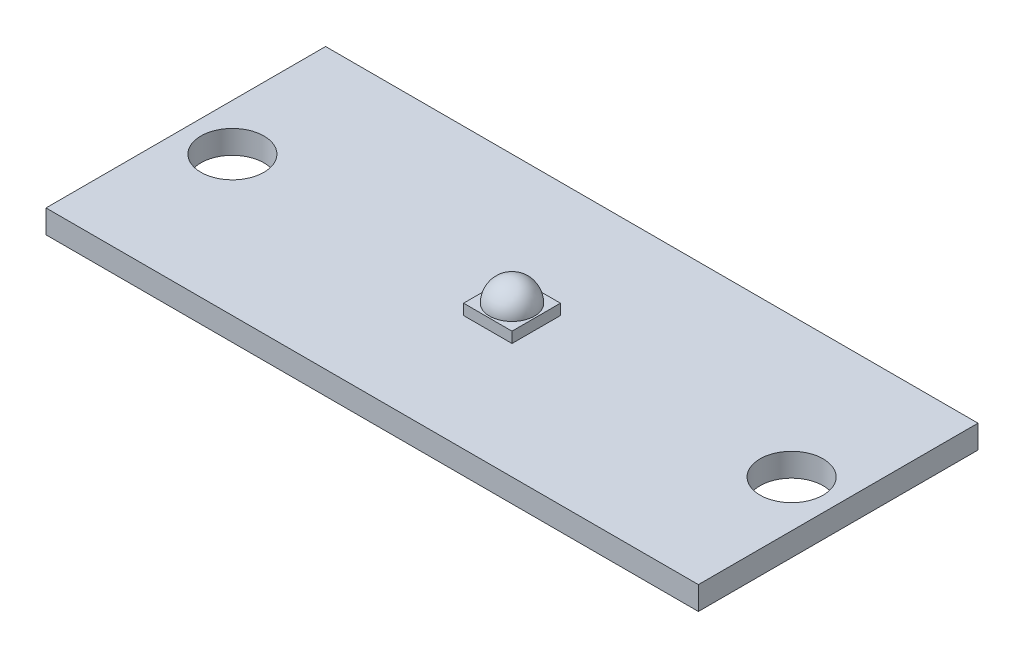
from build123d import *

# Parameters (mm, degrees)
SKETCH1_W = 44.45
SKETCH1_H = 19.05
SKETCH1_R = 2.1463
PCB_DEPTH = 1.5875
SKETCH2_W = 3.3
SKETCH2_H = 3.3
LED_DEPTH = 0.73


with BuildPart() as part:
    # Sketch1 → PCB (new body)
    with BuildSketch(Plane(origin=(0, 0, 0), x_dir=(1, 0, 0), z_dir=(0, 1, 0))):
        Rectangle(SKETCH1_W, SKETCH1_H)
        with Locations(Location((-19.05, 0, 0), (0, 0, 270))):
            Circle(SKETCH1_R, mode=Mode.SUBTRACT)
        with Locations(Location((19.05, 0, 0), (0, 0, 270))):
            Circle(SKETCH1_R, mode=Mode.SUBTRACT)
    extrude(amount=PCB_DEPTH)

    # Sketch2 → LED (add)
    with BuildSketch(Plane(origin=(0, 1.5875, 0), x_dir=(1, 0, 0), z_dir=(0, 1, 0))):
        Rectangle(SKETCH2_W, SKETCH2_H)
    extrude(amount=LED_DEPTH)

    # Sketch3 → Revolve1 (revolve)
    with BuildSketch(Plane(origin=(0, 0, 0), x_dir=(0, 0, -1), z_dir=(1, 0, 0))):
        with BuildLine():
            Line((0, 3.8475), (0, 2.3175))
            Line((0, 2.3175), (1.53, 2.3175))
            ThreePointArc((1.53, 2.3175), (1.081873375, 3.399373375), (0, 3.8475))
        make_face()
    revolve(axis=Axis((0, -1.749139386, 0), (0, 1, 0)))


solid = part.part
